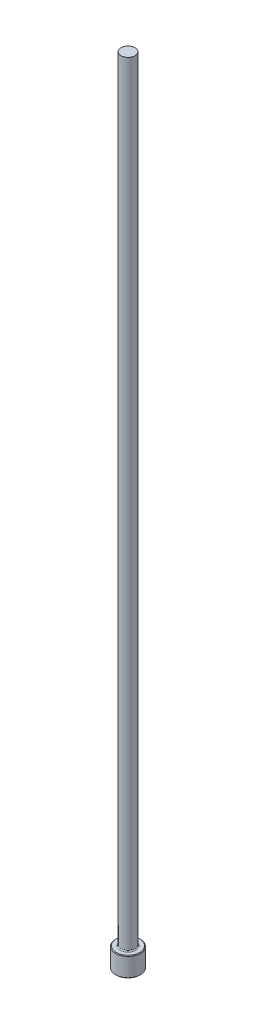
ISO-10303-21;
HEADER;
FILE_DESCRIPTION(('STEP AP214'),'2;1');
FILE_NAME('part.step','',(''),(''),'','','');
FILE_SCHEMA(('AUTOMOTIVE_DESIGN { 1 0 10303 214 1 1 1 1 }'));
ENDSEC;
DATA;
#1=APPLICATION_CONTEXT('core data for automotive mechanical design processes');
#2=APPLICATION_PROTOCOL_DEFINITION('international standard','automotive_design',2000,#1);
#3=PRODUCT_CONTEXT('',#1,'mechanical');
#4=PRODUCT('Part','Part','',(#3));
#5=PRODUCT_RELATED_PRODUCT_CATEGORY('part','',(#4));
#6=PRODUCT_DEFINITION_FORMATION('','',#4);
#7=PRODUCT_DEFINITION_CONTEXT('part definition',#1,'design');
#8=PRODUCT_DEFINITION('design','',#6,#7);
#9=PRODUCT_DEFINITION_SHAPE('','',#8);
#10=(LENGTH_UNIT() NAMED_UNIT(*) SI_UNIT(.MILLI.,.METRE.));
#11=(NAMED_UNIT(*) PLANE_ANGLE_UNIT() SI_UNIT($,.RADIAN.));
#12=(NAMED_UNIT(*) SI_UNIT($,.STERADIAN.) SOLID_ANGLE_UNIT());
#13=UNCERTAINTY_MEASURE_WITH_UNIT(LENGTH_MEASURE(1.E-05),#10,'distance_accuracy_value','');
#14=(GEOMETRIC_REPRESENTATION_CONTEXT(3) GLOBAL_UNCERTAINTY_ASSIGNED_CONTEXT((#13)) GLOBAL_UNIT_ASSIGNED_CONTEXT((#10,
#11,#12)) REPRESENTATION_CONTEXT('',''));
#15=CARTESIAN_POINT('',(0.,0.,0.));
#16=DIRECTION('',(0.,0.,1.));
#17=DIRECTION('',(1.,0.,0.));
#18=AXIS2_PLACEMENT_3D('',#15,#16,#17);
#19=CARTESIAN_POINT('',(0.,0.,0.));
#20=DIRECTION('',(0.,-1.,0.));
#21=DIRECTION('',(0.,0.,-1.));
#22=AXIS2_PLACEMENT_3D('',#19,#20,#21);
#23=PLANE('',#22);
#24=CARTESIAN_POINT('',(0.,0.,0.));
#25=DIRECTION('',(0.,-1.,0.));
#26=DIRECTION('',(0.,0.,-1.));
#27=AXIS2_PLACEMENT_3D('',#24,#25,#26);
#28=CIRCLE('',#27,0.939799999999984);
#29=CARTESIAN_POINT('',(0.,0.,0.939799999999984));
#30=VERTEX_POINT('',#29);
#31=EDGE_CURVE('E46',#30,#30,#28,.T.);
#32=ORIENTED_EDGE('',*,*,#31,.T.);
#33=EDGE_LOOP('',(#32));
#34=FACE_BOUND('',#33,.T.);
#35=ADVANCED_FACE('F35',(#34),#23,.T.);
#36=CARTESIAN_POINT('',(0.,259.958771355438,0.));
#37=DIRECTION('',(0.,1.,0.));
#38=DIRECTION('',(0.,0.,1.));
#39=AXIS2_PLACEMENT_3D('',#36,#37,#38);
#40=CYLINDRICAL_SURFACE('',#39,0.990599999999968);
#41=CARTESIAN_POINT('',(0.,1.52399999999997,0.));
#42=DIRECTION('',(0.,1.,0.));
#43=DIRECTION('',(0.,0.,1.));
#44=AXIS2_PLACEMENT_3D('',#41,#42,#43);
#45=CIRCLE('',#44,0.990599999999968);
#46=CARTESIAN_POINT('',(0.,1.52399999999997,0.990599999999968));
#47=VERTEX_POINT('',#46);
#48=EDGE_CURVE('E50',#47,#47,#45,.F.);
#49=ORIENTED_EDGE('',*,*,#48,.T.);
#50=EDGE_LOOP('',(#49));
#51=FACE_BOUND('',#50,.T.);
#52=CARTESIAN_POINT('',(0.,0.050799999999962,0.));
#53=DIRECTION('',(0.,-1.,0.));
#54=DIRECTION('',(0.,0.,-1.));
#55=AXIS2_PLACEMENT_3D('',#52,#53,#54);
#56=CIRCLE('',#55,0.990599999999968);
#57=CARTESIAN_POINT('',(0.,0.050799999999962,0.990599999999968));
#58=VERTEX_POINT('',#57);
#59=EDGE_CURVE('E55',#58,#58,#56,.F.);
#60=ORIENTED_EDGE('',*,*,#59,.T.);
#61=EDGE_LOOP('',(#60));
#62=FACE_BOUND('',#61,.T.);
#63=ADVANCED_FACE('F77',(#51,#62),#40,.T.);
#64=CARTESIAN_POINT('',(-0.990599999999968,1.5748,0.));
#65=DIRECTION('',(0.,1.,0.));
#66=DIRECTION('',(0.,0.,1.));
#67=AXIS2_PLACEMENT_3D('',#64,#65,#66);
#68=PLANE('',#67);
#69=CARTESIAN_POINT('',(0.,1.5748,0.));
#70=DIRECTION('',(0.,1.,0.));
#71=DIRECTION('',(0.,0.,1.));
#72=AXIS2_PLACEMENT_3D('',#69,#70,#71);
#73=CIRCLE('',#72,0.634999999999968);
#74=CARTESIAN_POINT('',(0.,1.5748,0.634999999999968));
#75=VERTEX_POINT('',#74);
#76=EDGE_CURVE('E10',#75,#75,#73,.F.);
#77=ORIENTED_EDGE('',*,*,#76,.T.);
#78=EDGE_LOOP('',(#77));
#79=FACE_BOUND('',#78,.T.);
#80=CARTESIAN_POINT('',(0.,1.5748,0.));
#81=DIRECTION('',(0.,1.,0.));
#82=DIRECTION('',(0.,0.,1.));
#83=AXIS2_PLACEMENT_3D('',#80,#81,#82);
#84=CIRCLE('',#83,0.939799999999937);
#85=CARTESIAN_POINT('',(0.,1.5748,0.939799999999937));
#86=VERTEX_POINT('',#85);
#87=EDGE_CURVE('E58',#86,#86,#84,.T.);
#88=ORIENTED_EDGE('',*,*,#87,.T.);
#89=EDGE_LOOP('',(#88));
#90=FACE_BOUND('',#89,.T.);
#91=ADVANCED_FACE('F69',(#79,#90),#68,.T.);
#92=CARTESIAN_POINT('',(0.,259.958771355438,0.));
#93=DIRECTION('',(0.,1.,0.));
#94=DIRECTION('',(0.,0.,1.));
#95=AXIS2_PLACEMENT_3D('',#92,#93,#94);
#96=CYLINDRICAL_SURFACE('',#95,0.558799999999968);
#97=CARTESIAN_POINT('',(0.,1.65100000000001,0.));
#98=DIRECTION('',(0.,1.,0.));
#99=DIRECTION('',(0.,0.,1.));
#100=AXIS2_PLACEMENT_3D('',#97,#98,#99);
#101=CIRCLE('',#100,0.558799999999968);
#102=CARTESIAN_POINT('',(0.,1.65100000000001,0.558799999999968));
#103=VERTEX_POINT('',#102);
#104=EDGE_CURVE('E42',#103,#103,#101,.T.);
#105=ORIENTED_EDGE('',*,*,#104,.T.);
#106=EDGE_LOOP('',(#105));
#107=FACE_BOUND('',#106,.T.);
#108=CARTESIAN_POINT('',(0.,63.5,0.));
#109=DIRECTION('',(0.,1.,0.));
#110=DIRECTION('',(0.,0.,1.));
#111=AXIS2_PLACEMENT_3D('',#108,#109,#110);
#112=CIRCLE('',#111,0.558799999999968);
#113=CARTESIAN_POINT('',(0.,63.5,0.558799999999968));
#114=VERTEX_POINT('',#113);
#115=EDGE_CURVE('E61',#114,#114,#112,.T.);
#116=ORIENTED_EDGE('',*,*,#115,.F.);
#117=EDGE_LOOP('',(#116));
#118=FACE_BOUND('',#117,.T.);
#119=ADVANCED_FACE('F67',(#107,#118),#96,.T.);
#120=CARTESIAN_POINT('',(-0.558799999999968,63.5,0.));
#121=DIRECTION('',(0.,1.,0.));
#122=DIRECTION('',(0.,0.,1.));
#123=AXIS2_PLACEMENT_3D('',#120,#121,#122);
#124=PLANE('',#123);
#125=ORIENTED_EDGE('',*,*,#115,.T.);
#126=EDGE_LOOP('',(#125));
#127=FACE_BOUND('',#126,.T.);
#128=ADVANCED_FACE('F65',(#127),#124,.T.);
#129=CARTESIAN_POINT('',(0.,1.57479999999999,0.));
#130=DIRECTION('',(0.,-1.,0.));
#131=DIRECTION('',(0.,0.,-1.));
#132=AXIS2_PLACEMENT_3D('',#129,#130,#131);
#133=CONICAL_SURFACE('',#132,0.939799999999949,0.785398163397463);
#134=ORIENTED_EDGE('',*,*,#48,.F.);
#135=EDGE_LOOP('',(#134));
#136=FACE_BOUND('',#135,.T.);
#137=ORIENTED_EDGE('',*,*,#87,.F.);
#138=EDGE_LOOP('',(#137));
#139=FACE_BOUND('',#138,.T.);
#140=ADVANCED_FACE('F75',(#136,#139),#133,.T.);
#141=CARTESIAN_POINT('',(0.,0.050799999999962,0.));
#142=DIRECTION('',(0.,1.,0.));
#143=DIRECTION('',(0.,0.,1.));
#144=AXIS2_PLACEMENT_3D('',#141,#142,#143);
#145=CONICAL_SURFACE('',#144,0.990599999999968,0.785398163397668);
#146=CARTESIAN_POINT('',(0.,0.,0.939799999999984));
#147=CARTESIAN_POINT('',(0.,0.000529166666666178,0.94032916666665));
#148=CARTESIAN_POINT('',(0.,0.00105833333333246,0.940858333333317));
#149=CARTESIAN_POINT('',(0.,0.00211666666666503,0.94191666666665));
#150=CARTESIAN_POINT('',(0.,0.00264583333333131,0.942445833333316));
#151=CARTESIAN_POINT('',(0.,0.00370416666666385,0.943504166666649));
#152=CARTESIAN_POINT('',(0.,0.0042333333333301,0.944033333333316));
#153=CARTESIAN_POINT('',(0.,0.00529166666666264,0.945091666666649));
#154=CARTESIAN_POINT('',(0.,0.00582083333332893,0.945620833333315));
#155=CARTESIAN_POINT('',(0.,0.00687916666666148,0.946679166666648));
#156=CARTESIAN_POINT('',(0.,0.00740833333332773,0.947208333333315));
#157=CARTESIAN_POINT('',(0.,0.00846666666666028,0.948266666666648));
#158=CARTESIAN_POINT('',(0.,0.00899583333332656,0.948795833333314));
#159=CARTESIAN_POINT('',(0.,0.0100541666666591,0.949854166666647));
#160=CARTESIAN_POINT('',(0.,0.0105833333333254,0.950383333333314));
#161=CARTESIAN_POINT('',(0.,0.0116416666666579,0.951441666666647));
#162=CARTESIAN_POINT('',(0.,0.0121708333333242,0.951970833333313));
#163=CARTESIAN_POINT('',(0.,0.0132291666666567,0.953029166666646));
#164=CARTESIAN_POINT('',(0.,0.013758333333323,0.953558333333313));
#165=CARTESIAN_POINT('',(0.,0.0148166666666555,0.954616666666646));
#166=CARTESIAN_POINT('',(0.,0.0153458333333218,0.955145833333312));
#167=CARTESIAN_POINT('',(0.,0.0164041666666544,0.956204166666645));
#168=CARTESIAN_POINT('',(0.,0.0169333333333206,0.956733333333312));
#169=CARTESIAN_POINT('',(0.,0.0179916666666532,0.957791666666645));
#170=CARTESIAN_POINT('',(0.,0.0185208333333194,0.958320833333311));
#171=CARTESIAN_POINT('',(0.,0.019579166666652,0.959379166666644));
#172=CARTESIAN_POINT('',(0.,0.0201083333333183,0.959908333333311));
#173=CARTESIAN_POINT('',(0.,0.0211666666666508,0.960966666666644));
#174=CARTESIAN_POINT('',(0.,0.0216958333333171,0.96149583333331));
#175=CARTESIAN_POINT('',(0.,0.0227541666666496,0.962554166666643));
#176=CARTESIAN_POINT('',(0.,0.0232833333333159,0.96308333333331));
#177=CARTESIAN_POINT('',(0.,0.0243416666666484,0.964141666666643));
#178=CARTESIAN_POINT('',(0.,0.0248708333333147,0.964670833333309));
#179=CARTESIAN_POINT('',(0.,0.0259291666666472,0.965729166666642));
#180=CARTESIAN_POINT('',(0.,0.0264583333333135,0.966258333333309));
#181=CARTESIAN_POINT('',(0.,0.0275166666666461,0.967316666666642));
#182=CARTESIAN_POINT('',(0.,0.0280458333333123,0.967845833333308));
#183=CARTESIAN_POINT('',(0.,0.0291041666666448,0.968904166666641));
#184=CARTESIAN_POINT('',(0.,0.0296333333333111,0.969433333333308));
#185=CARTESIAN_POINT('',(0.,0.0306916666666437,0.970491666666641));
#186=CARTESIAN_POINT('',(0.,0.03122083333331,0.971020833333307));
#187=CARTESIAN_POINT('',(0.,0.0322791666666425,0.97207916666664));
#188=CARTESIAN_POINT('',(0.,0.0328083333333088,0.972608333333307));
#189=CARTESIAN_POINT('',(0.,0.0338666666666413,0.97366666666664));
#190=CARTESIAN_POINT('',(0.,0.0343958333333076,0.974195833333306));
#191=CARTESIAN_POINT('',(0.,0.0354541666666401,0.975254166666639));
#192=CARTESIAN_POINT('',(0.,0.0359833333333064,0.975783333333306));
#193=CARTESIAN_POINT('',(0.,0.0370416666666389,0.976841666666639));
#194=CARTESIAN_POINT('',(0.,0.0375708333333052,0.977370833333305));
#195=CARTESIAN_POINT('',(0.,0.0386291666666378,0.978429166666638));
#196=CARTESIAN_POINT('',(0.,0.039158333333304,0.978958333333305));
#197=CARTESIAN_POINT('',(0.,0.0402166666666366,0.980016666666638));
#198=CARTESIAN_POINT('',(0.,0.0407458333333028,0.980545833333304));
#199=CARTESIAN_POINT('',(0.,0.0418041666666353,0.981604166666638));
#200=CARTESIAN_POINT('',(0.,0.0423333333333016,0.982133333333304));
#201=CARTESIAN_POINT('',(0.,0.0433916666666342,0.983191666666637));
#202=CARTESIAN_POINT('',(0.,0.0439208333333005,0.983720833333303));
#203=CARTESIAN_POINT('',(0.,0.044979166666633,0.984779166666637));
#204=CARTESIAN_POINT('',(0.,0.0455083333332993,0.985308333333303));
#205=CARTESIAN_POINT('',(0.,0.0465666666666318,0.986366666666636));
#206=CARTESIAN_POINT('',(0.,0.0470958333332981,0.986895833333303));
#207=CARTESIAN_POINT('',(0.,0.0481541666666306,0.987954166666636));
#208=CARTESIAN_POINT('',(0.,0.0486833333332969,0.988483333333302));
#209=CARTESIAN_POINT('',(0.,0.0497416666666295,0.989541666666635));
#210=CARTESIAN_POINT('',(0.,0.0502708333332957,0.990070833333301));
#211=CARTESIAN_POINT('',(0.,0.050799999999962,0.990599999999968));
#212=B_SPLINE_CURVE_WITH_KNOTS('',3,(#146,#147,#148,#149,#150,#151,#152,#153,#154,#155,#156,
#157,#158,#159,#160,#161,#162,#163,#164,#165,#166,#167,#168,#169,#170,#171,#172,#173,#174,#175,
#176,#177,#178,#179,#180,#181,#182,#183,#184,#185,#186,#187,#188,#189,#190,#191,#192,#193,#194,
#195,#196,#197,#198,#199,#200,#201,#202,#203,#204,#205,#206,#207,#208,#209,#210,#211),
.UNSPECIFIED.,.F.,.F.,(4,2,2,2,2,2,2,2,2,2,2,2,2,2,2,2,2,2,2,2,2,2,2,2,2,2,2,2,2,2,2,2,4),(0.,
0.00224506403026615,0.00449012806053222,0.00673519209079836,0.00898025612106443,
0.0112253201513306,0.0134703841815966,0.0157154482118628,0.0179605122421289,0.020205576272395,
0.0224506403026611,0.0246957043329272,0.0269407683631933,0.0291858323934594,0.0314308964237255,
0.0336759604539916,0.0359210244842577,0.0381660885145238,0.0404111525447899,0.042656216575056,
0.0449012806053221,0.0471463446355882,0.0493914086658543,0.0516364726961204,0.0538815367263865,
0.0561266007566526,0.0583716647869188,0.0606167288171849,0.0628617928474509,0.065106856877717,
0.0673519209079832,0.0695969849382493,0.0718420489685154),.UNSPECIFIED.);
#213=EDGE_CURVE('BSEAM89',#30,#58,#212,.T.);
#214=ORIENTED_EDGE('',*,*,#31,.F.);
#215=ORIENTED_EDGE('',*,*,#59,.F.);
#216=ORIENTED_EDGE('',*,*,#213,.T.);
#217=ORIENTED_EDGE('',*,*,#213,.F.);
#218=EDGE_LOOP('',(#214,#216,#215,#217));
#219=FACE_BOUND('',#218,.T.);
#220=ADVANCED_FACE('F89',(#219),#145,.T.);
#221=CARTESIAN_POINT('',(0.,1.65100000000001,0.));
#222=DIRECTION('',(0.,1.,0.));
#223=DIRECTION('',(0.,0.,1.));
#224=AXIS2_PLACEMENT_3D('',#221,#222,#223);
#225=TOROIDAL_SURFACE('',#224,0.634999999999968,0.0762);
#226=ORIENTED_EDGE('',*,*,#76,.F.);
#227=EDGE_LOOP('',(#226));
#228=FACE_BOUND('',#227,.T.);
#229=ORIENTED_EDGE('',*,*,#104,.F.);
#230=EDGE_LOOP('',(#229));
#231=FACE_BOUND('',#230,.T.);
#232=ADVANCED_FACE('F37',(#228,#231),#225,.F.);
#233=CLOSED_SHELL('',(#35,#63,#91,#119,#128,#140,#220,#232));
#234=MANIFOLD_SOLID_BREP('B2',#233);
#235=ADVANCED_BREP_SHAPE_REPRESENTATION('',(#18,#234),#14);
#236=SHAPE_DEFINITION_REPRESENTATION(#9,#235);
ENDSEC;
END-ISO-10303-21;
